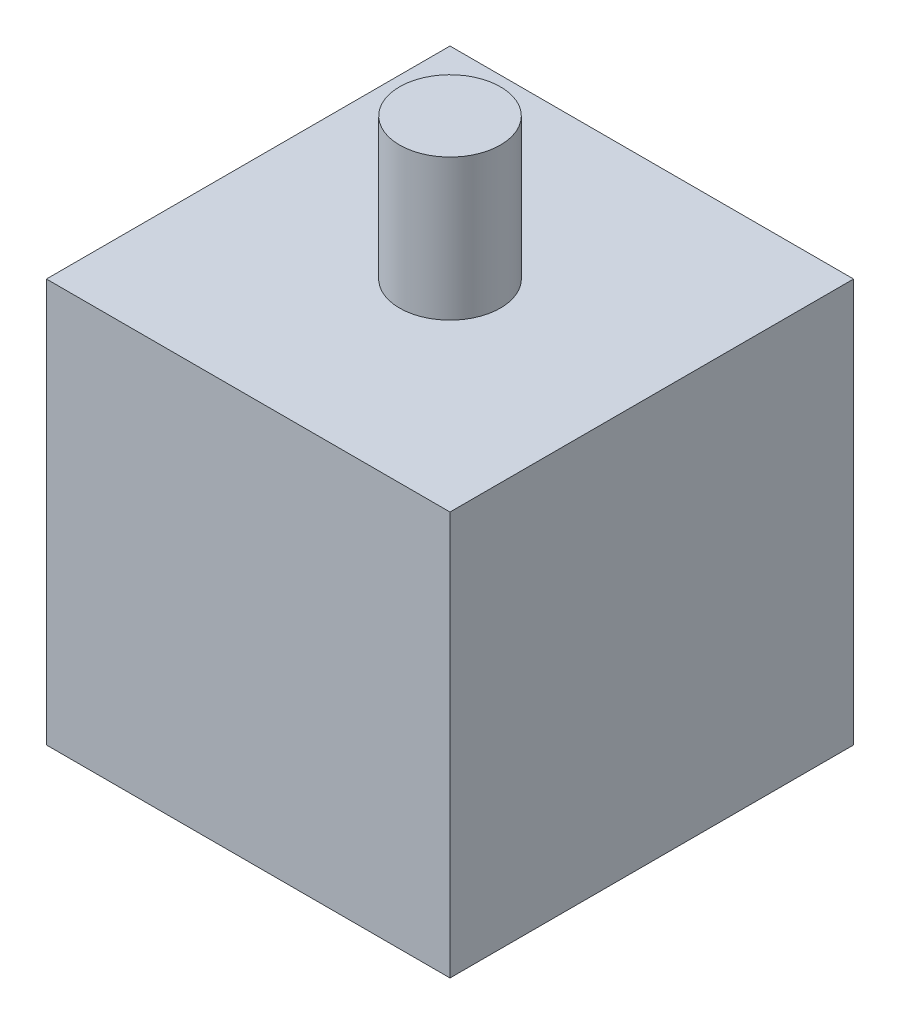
from build123d import *

# Parameters (mm, degrees)
SKETCH2_W           = 20
SKETCH2_H           = 20
BOSS_EXTRUDE1_DEPTH = 20
SKETCH3_R           = 2.5
BOSS_EXTRUDE2_DEPTH = 7


with BuildPart() as part:
    # Sketch2 → Boss-Extrude1 (new body)
    with BuildSketch(Plane(origin=(0, 0, 0), x_dir=(1, 0, 0), z_dir=(0, 1, 0))):
        with Locations((10, 10)):
            Rectangle(SKETCH2_W, SKETCH2_H)
    extrude(amount=BOSS_EXTRUDE1_DEPTH)

    # Sketch3 → Boss-Extrude2 (add)
    with BuildSketch(Plane(origin=(0, 20, 0), x_dir=(1, 0, 0), z_dir=(0, 1, 0))):
        with Locations(Location((10, 10, 0), (0, 0, 270))):
            Circle(SKETCH3_R)
    extrude(amount=BOSS_EXTRUDE2_DEPTH)


solid = part.part
